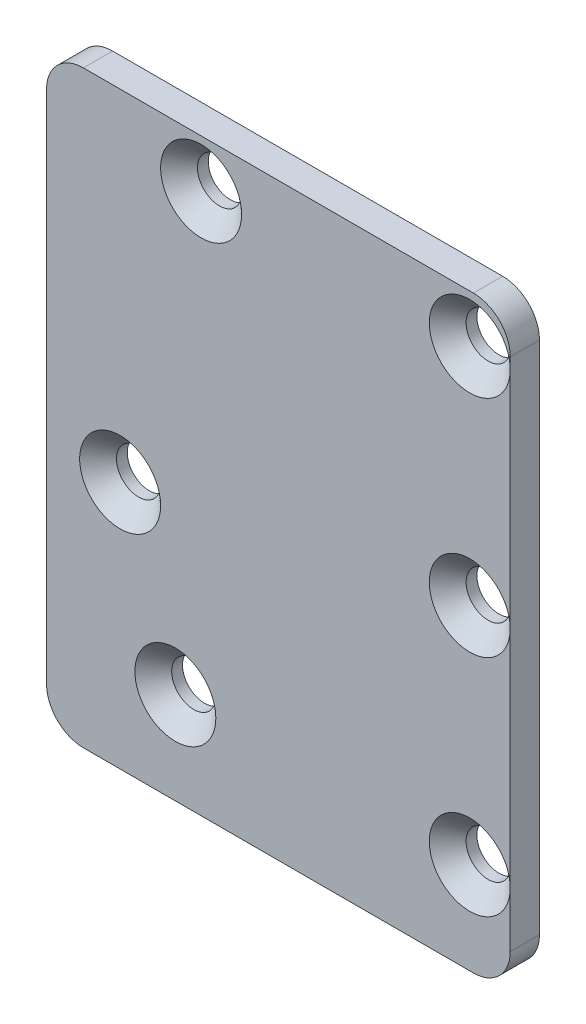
from build123d import *

# Parameters (mm, degrees)
SKETCH1_W                                      = 25.2
SKETCH1_H                                      = 32
BOSS_EXTRUDE1_DEPTH                            = 1.5875
CSK_FOR_M2_FLAT_HEAD_MACHINE_SCREW1_AT_2_COUNT = 2
CSK_FOR_M2_FLAT_HEAD_MACHINE_SCREW1_AT_2_PITCH = 16
CSK_FOR_M2_FLAT_HEAD_MACHINE_SCREW1_AT_3_COUNT = 2
CSK_FOR_M2_FLAT_HEAD_MACHINE_SCREW1_AT_3_PITCH = 20.120636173
CSK_FOR_M2_FLAT_HEAD_MACHINE_SCREW1_AT_4_COUNT = 2
CSK_FOR_M2_FLAT_HEAD_MACHINE_SCREW1_AT_4_PITCH = 29.17807396
CSK_FOR_M2_FLAT_HEAD_MACHINE_SCREW1_AT_5_COUNT = 2
CSK_FOR_M2_FLAT_HEAD_MACHINE_SCREW1_AT_5_PITCH = 9.013878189
CSK_FOR_M2_FLAT_HEAD_MACHINE_SCREW1_AT_6_COUNT = 2
CSK_FOR_M2_FLAT_HEAD_MACHINE_SCREW1_AT_6_PITCH = 24.440130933
CUT_EXTRUDE2_DEPTH                             = 0.75
FILLET1_R                                      = 2


with BuildPart() as part:
    # Sketch1 → Boss-Extrude1 (new body)
    with BuildSketch(Plane.XY):
        with Locations((12.6, 16)):
            Rectangle(SKETCH1_W, SKETCH1_H)
    extrude(amount=BOSS_EXTRUDE1_DEPTH)

    # Sketch2 → CSK for M2 Flat Head Machine Screw1 (revolve, cut)
    with BuildSketch(Plane(origin=(7, 5, 1.5875), x_dir=(0, -1, 0), z_dir=(1, 0, 0))):
        Polygon((0, 0), (0, 1.5875), (1.2, 1.5875), (1.2, 1), (2.2, 0), align=None)
    csk_for_m2_flat_head_machine_screw1 = revolve(axis=Axis((7, 5, 7.9375), (0, 0, -1)), mode=Mode.SUBTRACT)

    # CSK for M2 Flat Head Machine Screw1 at 2: CSK for M2 Flat Head Machine Screw1 ×2
    with Locations(*[(i * CSK_FOR_M2_FLAT_HEAD_MACHINE_SCREW1_AT_2_PITCH, 0, 0) for i in range(1, CSK_FOR_M2_FLAT_HEAD_MACHINE_SCREW1_AT_2_COUNT)]):
        add(csk_for_m2_flat_head_machine_screw1, mode=Mode.SUBTRACT)

    # CSK for M2 Flat Head Machine Screw1 at 3: CSK for M2 Flat Head Machine Screw1 ×2
    with Locations(*[Vector(0.7952034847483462, 0.6063426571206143, 0) * (i * CSK_FOR_M2_FLAT_HEAD_MACHINE_SCREW1_AT_3_PITCH) for i in range(1, CSK_FOR_M2_FLAT_HEAD_MACHINE_SCREW1_AT_3_COUNT)]):
        add(csk_for_m2_flat_head_machine_screw1, mode=Mode.SUBTRACT)

    # CSK for M2 Flat Head Machine Screw1 at 4: CSK for M2 Flat Head Machine Screw1 ×2
    with Locations(*[Vector(0.5483569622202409, 0.8362443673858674, 0) * (i * CSK_FOR_M2_FLAT_HEAD_MACHINE_SCREW1_AT_4_PITCH) for i in range(1, CSK_FOR_M2_FLAT_HEAD_MACHINE_SCREW1_AT_4_COUNT)]):
        add(csk_for_m2_flat_head_machine_screw1, mode=Mode.SUBTRACT)

    # CSK for M2 Flat Head Machine Screw1 at 5: CSK for M2 Flat Head Machine Screw1 ×2
    with Locations(*[Vector(-0.3328201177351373, 0.9429903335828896, 0) * (i * CSK_FOR_M2_FLAT_HEAD_MACHINE_SCREW1_AT_5_PITCH) for i in range(1, CSK_FOR_M2_FLAT_HEAD_MACHINE_SCREW1_AT_5_COUNT)]):
        add(csk_for_m2_flat_head_machine_screw1, mode=Mode.SUBTRACT)

    # CSK for M2 Flat Head Machine Screw1 at 6: CSK for M2 Flat Head Machine Screw1 ×2
    with Locations(*[Vector(0.05728283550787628, 0.9983579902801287, 0) * (i * CSK_FOR_M2_FLAT_HEAD_MACHINE_SCREW1_AT_6_PITCH) for i in range(1, CSK_FOR_M2_FLAT_HEAD_MACHINE_SCREW1_AT_6_COUNT)]):
        add(csk_for_m2_flat_head_machine_screw1, mode=Mode.SUBTRACT)

    # Sketch5 → Cut-Extrude2 (cut)
    # profile 1 of 2: a face of its own
    with BuildSketch(Plane(origin=(0, 0, 0), x_dir=(-1, 0, 0), z_dir=(0, 0, -1))):
        with BuildLine():
            Line((-4.111109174, 24.229920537), (-16.911109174, 14.129920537))
            ThreePointArc((-16.911109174, 14.129920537), (-19.720079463, 14.461109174), (-19.388890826, 17.270079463))
            Line((-19.388890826, 17.270079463), (-6.588890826, 27.370079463))
            ThreePointArc((-6.588890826, 27.370079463), (-3.779920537, 27.038890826), (-4.111109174, 24.229920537))
        make_face()
        with BuildLine():
            Line((-18.645556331, 16.328031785), (-5.845556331, 26.428031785))
            ThreePointArc((-5.845556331, 26.428031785), (-4.721968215, 26.295556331), (-4.854443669, 25.171968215))
            Line((-4.854443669, 25.171968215), (-17.654443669, 15.071968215))
            ThreePointArc((-17.654443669, 15.071968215), (-18.778031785, 15.204443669), (-18.645556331, 16.328031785))
        make_face(mode=Mode.SUBTRACT)
    # profile 2 of 2: a face of its own
    with BuildSketch(Plane(origin=(0, 0, 0), x_dir=(-1, 0, 0), z_dir=(0, 0, -1))):
        with BuildLine():
            Line((-0.949405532, 19.772297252), (-16.749405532, 4.272297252))
            ThreePointArc((-16.749405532, 4.272297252), (-19.577702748, 4.299405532), (-19.550594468, 7.127702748))
            Line((-19.550594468, 7.127702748), (-3.750594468, 22.627702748))
            ThreePointArc((-3.750594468, 22.627702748), (-0.922297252, 22.600594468), (-0.949405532, 19.772297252))
        make_face()
        with BuildLine():
            Line((-18.710237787, 6.271081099), (-2.910237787, 21.771081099))
            ThreePointArc((-2.910237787, 21.771081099), (-1.778918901, 21.760237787), (-1.789762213, 20.628918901))
            Line((-1.789762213, 20.628918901), (-17.589762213, 5.128918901))
            ThreePointArc((-17.589762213, 5.128918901), (-18.721081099, 5.139762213), (-18.710237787, 6.271081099))
        make_face(mode=Mode.SUBTRACT)
    extrude(amount=-CUT_EXTRUDE2_DEPTH, mode=Mode.SUBTRACT)

    # Fillet1
    fillet1_edges = [part.edges().sort_by_distance(p)[0] for p in [
        (0, 32, 0.79375),
        (25.2, 32, 0.79375),
        (25.2, 0, 0.79375),
        (0, 0, 0.79375),
    ]]
    fillet(fillet1_edges, radius=FILLET1_R)


solid = part.part
